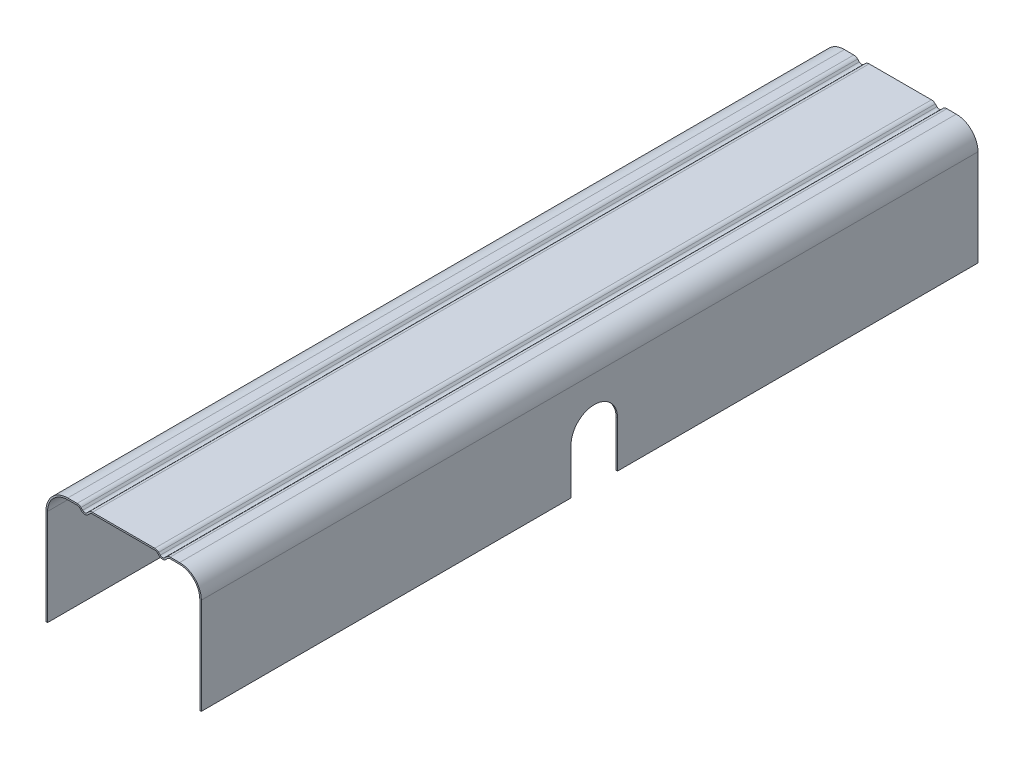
ISO-10303-21;
HEADER;
FILE_DESCRIPTION(('STEP AP214'),'2;1');
FILE_NAME('part.step','',(''),(''),'','','');
FILE_SCHEMA(('AUTOMOTIVE_DESIGN { 1 0 10303 214 1 1 1 1 }'));
ENDSEC;
DATA;
#1=APPLICATION_CONTEXT('core data for automotive mechanical design processes');
#2=APPLICATION_PROTOCOL_DEFINITION('international standard','automotive_design',2000,#1);
#3=PRODUCT_CONTEXT('',#1,'mechanical');
#4=PRODUCT('Part','Part','',(#3));
#5=PRODUCT_RELATED_PRODUCT_CATEGORY('part','',(#4));
#6=PRODUCT_DEFINITION_FORMATION('','',#4);
#7=PRODUCT_DEFINITION_CONTEXT('part definition',#1,'design');
#8=PRODUCT_DEFINITION('design','',#6,#7);
#9=PRODUCT_DEFINITION_SHAPE('','',#8);
#10=(LENGTH_UNIT() NAMED_UNIT(*) SI_UNIT(.MILLI.,.METRE.));
#11=(NAMED_UNIT(*) PLANE_ANGLE_UNIT() SI_UNIT($,.RADIAN.));
#12=(NAMED_UNIT(*) SI_UNIT($,.STERADIAN.) SOLID_ANGLE_UNIT());
#13=UNCERTAINTY_MEASURE_WITH_UNIT(LENGTH_MEASURE(1.E-05),#10,'distance_accuracy_value','');
#14=(GEOMETRIC_REPRESENTATION_CONTEXT(3) GLOBAL_UNCERTAINTY_ASSIGNED_CONTEXT((#13)) GLOBAL_UNIT_ASSIGNED_CONTEXT((#10,
#11,#12)) REPRESENTATION_CONTEXT('',''));
#15=CARTESIAN_POINT('',(0.,0.,0.));
#16=DIRECTION('',(0.,0.,1.));
#17=DIRECTION('',(1.,0.,0.));
#18=AXIS2_PLACEMENT_3D('',#15,#16,#17);
#19=CARTESIAN_POINT('',(50.,-23.,500.));
#20=DIRECTION('',(0.,-1.,0.));
#21=DIRECTION('',(0.,0.,-1.));
#22=AXIS2_PLACEMENT_3D('',#19,#20,#21);
#23=PLANE('',#22);
#24=DIRECTION('',(-1.,0.,0.));
#25=VECTOR('',#24,1.);
#26=CARTESIAN_POINT('',(50.,-23.,262.000000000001));
#27=LINE('',#26,#25);
#28=CARTESIAN_POINT('',(50.,-23.,262.000000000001));
#29=VERTEX_POINT('',#28);
#30=CARTESIAN_POINT('',(49.,-23.,262.000000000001));
#31=VERTEX_POINT('',#30);
#32=EDGE_CURVE('E357',#29,#31,#27,.T.);
#33=ORIENTED_EDGE('',*,*,#32,.F.);
#34=DIRECTION('',(0.,0.,-1.));
#35=VECTOR('',#34,1.);
#36=CARTESIAN_POINT('',(50.,-23.,500.));
#37=LINE('',#36,#35);
#38=CARTESIAN_POINT('',(50.,-23.,500.));
#39=VERTEX_POINT('',#38);
#40=EDGE_CURVE('E636',#39,#29,#37,.T.);
#41=ORIENTED_EDGE('',*,*,#40,.F.);
#42=DIRECTION('',(-1.,0.,0.));
#43=VECTOR('',#42,1.);
#44=CARTESIAN_POINT('',(50.,-23.,500.));
#45=LINE('',#44,#43);
#46=CARTESIAN_POINT('',(49.,-23.,500.));
#47=VERTEX_POINT('',#46);
#48=EDGE_CURVE('E459',#39,#47,#45,.T.);
#49=ORIENTED_EDGE('',*,*,#48,.T.);
#50=DIRECTION('',(0.,0.,-1.));
#51=VECTOR('',#50,1.);
#52=CARTESIAN_POINT('',(49.,-23.,500.));
#53=LINE('',#52,#51);
#54=EDGE_CURVE('E640',#47,#31,#53,.T.);
#55=ORIENTED_EDGE('',*,*,#54,.T.);
#56=EDGE_LOOP('',(#33,#41,#49,#55));
#57=FACE_BOUND('',#56,.T.);
#58=ADVANCED_FACE('F31',(#57),#23,.T.);
#59=CARTESIAN_POINT('',(-49.,-23.,500.));
#60=DIRECTION('',(0.,-1.,0.));
#61=DIRECTION('',(0.,0.,-1.));
#62=AXIS2_PLACEMENT_3D('',#59,#60,#61);
#63=PLANE('',#62);
#64=DIRECTION('',(-1.,0.,0.));
#65=VECTOR('',#64,1.);
#66=CARTESIAN_POINT('',(-49.,-23.,262.000000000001));
#67=LINE('',#66,#65);
#68=CARTESIAN_POINT('',(-49.,-23.,262.000000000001));
#69=VERTEX_POINT('',#68);
#70=CARTESIAN_POINT('',(-50.,-23.,262.000000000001));
#71=VERTEX_POINT('',#70);
#72=EDGE_CURVE('E355',#69,#71,#67,.T.);
#73=ORIENTED_EDGE('',*,*,#72,.F.);
#74=DIRECTION('',(0.,0.,-1.));
#75=VECTOR('',#74,1.);
#76=CARTESIAN_POINT('',(-49.,-23.,500.));
#77=LINE('',#76,#75);
#78=CARTESIAN_POINT('',(-49.,-23.,500.));
#79=VERTEX_POINT('',#78);
#80=EDGE_CURVE('E597',#79,#69,#77,.T.);
#81=ORIENTED_EDGE('',*,*,#80,.F.);
#82=DIRECTION('',(-1.,0.,0.));
#83=VECTOR('',#82,1.);
#84=CARTESIAN_POINT('',(-49.,-23.,500.));
#85=LINE('',#84,#83);
#86=CARTESIAN_POINT('',(-50.,-23.,500.));
#87=VERTEX_POINT('',#86);
#88=EDGE_CURVE('E513',#79,#87,#85,.T.);
#89=ORIENTED_EDGE('',*,*,#88,.T.);
#90=DIRECTION('',(0.,0.,-1.));
#91=VECTOR('',#90,1.);
#92=CARTESIAN_POINT('',(-50.,-23.,500.));
#93=LINE('',#92,#91);
#94=EDGE_CURVE('E600',#87,#71,#93,.T.);
#95=ORIENTED_EDGE('',*,*,#94,.T.);
#96=EDGE_LOOP('',(#73,#81,#89,#95));
#97=FACE_BOUND('',#96,.T.);
#98=ADVANCED_FACE('F651',(#97),#63,.T.);
#99=CARTESIAN_POINT('',(49.,39.,500.));
#100=DIRECTION('',(1.,0.,0.));
#101=DIRECTION('',(0.,1.,0.));
#102=AXIS2_PLACEMENT_3D('',#99,#100,#101);
#103=PLANE('',#102);
#104=CARTESIAN_POINT('',(49.,6.53650459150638,247.000000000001));
#105=DIRECTION('',(1.,0.,0.));
#106=DIRECTION('',(0.,1.,0.));
#107=AXIS2_PLACEMENT_3D('',#104,#105,#106);
#108=CIRCLE('',#107,15.);
#109=CARTESIAN_POINT('',(49.,6.53650459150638,232.000000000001));
#110=VERTEX_POINT('',#109);
#111=CARTESIAN_POINT('',(49.,6.53650459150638,262.000000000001));
#112=VERTEX_POINT('',#111);
#113=EDGE_CURVE('E362',#110,#112,#108,.T.);
#114=ORIENTED_EDGE('',*,*,#113,.T.);
#115=DIRECTION('',(0.,-1.,0.));
#116=VECTOR('',#115,1.);
#117=CARTESIAN_POINT('',(49.,39.,262.000000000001));
#118=LINE('',#117,#116);
#119=EDGE_CURVE('E359',#112,#31,#118,.T.);
#120=ORIENTED_EDGE('',*,*,#119,.T.);
#121=ORIENTED_EDGE('',*,*,#54,.F.);
#122=DIRECTION('',(0.,-1.,0.));
#123=VECTOR('',#122,1.);
#124=CARTESIAN_POINT('',(49.,39.,500.));
#125=LINE('',#124,#123);
#126=CARTESIAN_POINT('',(49.,39.,500.));
#127=VERTEX_POINT('',#126);
#128=EDGE_CURVE('E457',#127,#47,#125,.T.);
#129=ORIENTED_EDGE('',*,*,#128,.F.);
#130=DIRECTION('',(0.,0.,-1.));
#131=VECTOR('',#130,1.);
#132=CARTESIAN_POINT('',(49.,39.,500.));
#133=LINE('',#132,#131);
#134=CARTESIAN_POINT('',(49.,39.,0.));
#135=VERTEX_POINT('',#134);
#136=EDGE_CURVE('E548',#127,#135,#133,.T.);
#137=ORIENTED_EDGE('',*,*,#136,.T.);
#138=DIRECTION('',(0.,-1.,0.));
#139=VECTOR('',#138,1.);
#140=CARTESIAN_POINT('',(49.,39.,0.));
#141=LINE('',#140,#139);
#142=CARTESIAN_POINT('',(49.,-23.,0.));
#143=VERTEX_POINT('',#142);
#144=EDGE_CURVE('E365',#135,#143,#141,.T.);
#145=ORIENTED_EDGE('',*,*,#144,.T.);
#146=CARTESIAN_POINT('',(49.,-23.,232.000000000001));
#147=VERTEX_POINT('',#146);
#148=EDGE_CURVE('E639',#147,#143,#53,.T.);
#149=ORIENTED_EDGE('',*,*,#148,.F.);
#150=DIRECTION('',(0.,1.,0.));
#151=VECTOR('',#150,1.);
#152=CARTESIAN_POINT('',(49.,39.,232.000000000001));
#153=LINE('',#152,#151);
#154=EDGE_CURVE('E352',#147,#110,#153,.T.);
#155=ORIENTED_EDGE('',*,*,#154,.T.);
#156=EDGE_LOOP('',(#114,#120,#121,#129,#137,#145,#149,#155));
#157=FACE_BOUND('',#156,.T.);
#158=ADVANCED_FACE('F33',(#157),#103,.F.);
#159=DIRECTION('',(1.,0.,0.));
#160=VECTOR('',#159,1.);
#161=CARTESIAN_POINT('',(50.,-23.,232.000000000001));
#162=LINE('',#161,#160);
#163=CARTESIAN_POINT('',(50.,-23.,232.000000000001));
#164=VERTEX_POINT('',#163);
#165=EDGE_CURVE('E46',#147,#164,#162,.T.);
#166=ORIENTED_EDGE('',*,*,#165,.F.);
#167=ORIENTED_EDGE('',*,*,#148,.T.);
#168=DIRECTION('',(-1.,0.,0.));
#169=VECTOR('',#168,1.);
#170=CARTESIAN_POINT('',(50.,-23.,0.));
#171=LINE('',#170,#169);
#172=CARTESIAN_POINT('',(50.,-23.,0.));
#173=VERTEX_POINT('',#172);
#174=EDGE_CURVE('E368',#173,#143,#171,.T.);
#175=ORIENTED_EDGE('',*,*,#174,.F.);
#176=EDGE_CURVE('E635',#164,#173,#37,.T.);
#177=ORIENTED_EDGE('',*,*,#176,.F.);
#178=EDGE_LOOP('',(#166,#167,#175,#177));
#179=FACE_BOUND('',#178,.T.);
#180=ADVANCED_FACE('F812',(#179),#23,.T.);
#181=CARTESIAN_POINT('',(50.,39.,500.));
#182=DIRECTION('',(1.,0.,0.));
#183=DIRECTION('',(0.,1.,0.));
#184=AXIS2_PLACEMENT_3D('',#181,#182,#183);
#185=PLANE('',#184);
#186=DIRECTION('',(0.,1.,0.));
#187=VECTOR('',#186,1.);
#188=CARTESIAN_POINT('',(50.,6.53650459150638,262.000000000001));
#189=LINE('',#188,#187);
#190=CARTESIAN_POINT('',(50.,6.53650459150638,262.000000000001));
#191=VERTEX_POINT('',#190);
#192=EDGE_CURVE('E320',#29,#191,#189,.T.);
#193=ORIENTED_EDGE('',*,*,#192,.T.);
#194=CARTESIAN_POINT('',(50.,6.53650459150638,247.000000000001));
#195=DIRECTION('',(-1.,0.,0.));
#196=DIRECTION('',(0.,-1.,0.));
#197=AXIS2_PLACEMENT_3D('',#194,#195,#196);
#198=CIRCLE('',#197,15.);
#199=CARTESIAN_POINT('',(50.,6.53650459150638,232.000000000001));
#200=VERTEX_POINT('',#199);
#201=EDGE_CURVE('E337',#191,#200,#198,.T.);
#202=ORIENTED_EDGE('',*,*,#201,.T.);
#203=DIRECTION('',(0.,-1.,0.));
#204=VECTOR('',#203,1.);
#205=CARTESIAN_POINT('',(50.,6.53650459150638,232.000000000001));
#206=LINE('',#205,#204);
#207=EDGE_CURVE('E342',#200,#164,#206,.T.);
#208=ORIENTED_EDGE('',*,*,#207,.T.);
#209=ORIENTED_EDGE('',*,*,#176,.T.);
#210=DIRECTION('',(0.,-1.,0.));
#211=VECTOR('',#210,1.);
#212=CARTESIAN_POINT('',(50.,39.,0.));
#213=LINE('',#212,#211);
#214=CARTESIAN_POINT('',(50.,39.,0.));
#215=VERTEX_POINT('',#214);
#216=EDGE_CURVE('E371',#215,#173,#213,.T.);
#217=ORIENTED_EDGE('',*,*,#216,.F.);
#218=DIRECTION('',(0.,0.,-1.));
#219=VECTOR('',#218,1.);
#220=CARTESIAN_POINT('',(50.,39.,500.));
#221=LINE('',#220,#219);
#222=CARTESIAN_POINT('',(50.,39.,500.));
#223=VERTEX_POINT('',#222);
#224=EDGE_CURVE('E633',#223,#215,#221,.T.);
#225=ORIENTED_EDGE('',*,*,#224,.F.);
#226=DIRECTION('',(0.,-1.,0.));
#227=VECTOR('',#226,1.);
#228=CARTESIAN_POINT('',(50.,39.,500.));
#229=LINE('',#228,#227);
#230=EDGE_CURVE('E462',#223,#39,#229,.T.);
#231=ORIENTED_EDGE('',*,*,#230,.T.);
#232=ORIENTED_EDGE('',*,*,#40,.T.);
#233=EDGE_LOOP('',(#193,#202,#208,#209,#217,#225,#231,#232));
#234=FACE_BOUND('',#233,.T.);
#235=ADVANCED_FACE('F753',(#234),#185,.T.);
#236=CARTESIAN_POINT('',(36.,39.,500.));
#237=DIRECTION('',(0.,0.,-1.));
#238=DIRECTION('',(-1.,0.,0.));
#239=AXIS2_PLACEMENT_3D('',#236,#237,#238);
#240=CYLINDRICAL_SURFACE('',#239,14.);
#241=CARTESIAN_POINT('',(36.,39.,0.));
#242=DIRECTION('',(0.,0.,-1.));
#243=DIRECTION('',(1.,0.,0.));
#244=AXIS2_PLACEMENT_3D('',#241,#242,#243);
#245=CIRCLE('',#244,14.);
#246=CARTESIAN_POINT('',(36.,53.,0.));
#247=VERTEX_POINT('',#246);
#248=EDGE_CURVE('E374',#247,#215,#245,.T.);
#249=ORIENTED_EDGE('',*,*,#248,.F.);
#250=DIRECTION('',(0.,0.,-1.));
#251=VECTOR('',#250,1.);
#252=CARTESIAN_POINT('',(36.,53.,500.));
#253=LINE('',#252,#251);
#254=CARTESIAN_POINT('',(36.,53.,500.));
#255=VERTEX_POINT('',#254);
#256=EDGE_CURVE('E631',#255,#247,#253,.T.);
#257=ORIENTED_EDGE('',*,*,#256,.F.);
#258=CARTESIAN_POINT('',(36.,39.,500.));
#259=DIRECTION('',(0.,0.,-1.));
#260=DIRECTION('',(1.,0.,0.));
#261=AXIS2_PLACEMENT_3D('',#258,#259,#260);
#262=CIRCLE('',#261,14.);
#263=EDGE_CURVE('E465',#255,#223,#262,.T.);
#264=ORIENTED_EDGE('',*,*,#263,.T.);
#265=ORIENTED_EDGE('',*,*,#224,.T.);
#266=EDGE_LOOP('',(#249,#257,#264,#265));
#267=FACE_BOUND('',#266,.T.);
#268=ADVANCED_FACE('F759',(#267),#240,.T.);
#269=CARTESIAN_POINT('',(29.9497474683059,53.,500.));
#270=DIRECTION('',(0.,1.,0.));
#271=DIRECTION('',(0.,0.,1.));
#272=AXIS2_PLACEMENT_3D('',#269,#270,#271);
#273=PLANE('',#272);
#274=DIRECTION('',(1.,0.,0.));
#275=VECTOR('',#274,1.);
#276=CARTESIAN_POINT('',(29.9497474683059,53.,0.));
#277=LINE('',#276,#275);
#278=CARTESIAN_POINT('',(29.9497474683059,53.,0.));
#279=VERTEX_POINT('',#278);
#280=EDGE_CURVE('E377',#279,#247,#277,.T.);
#281=ORIENTED_EDGE('',*,*,#280,.F.);
#282=DIRECTION('',(0.,0.,-1.));
#283=VECTOR('',#282,1.);
#284=CARTESIAN_POINT('',(29.9497474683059,53.,500.));
#285=LINE('',#284,#283);
#286=CARTESIAN_POINT('',(29.9497474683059,53.,500.));
#287=VERTEX_POINT('',#286);
#288=EDGE_CURVE('E629',#287,#279,#285,.T.);
#289=ORIENTED_EDGE('',*,*,#288,.F.);
#290=DIRECTION('',(1.,0.,0.));
#291=VECTOR('',#290,1.);
#292=CARTESIAN_POINT('',(29.9497474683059,53.,500.));
#293=LINE('',#292,#291);
#294=EDGE_CURVE('E468',#287,#255,#293,.T.);
#295=ORIENTED_EDGE('',*,*,#294,.T.);
#296=ORIENTED_EDGE('',*,*,#256,.T.);
#297=EDGE_LOOP('',(#281,#289,#295,#296));
#298=FACE_BOUND('',#297,.T.);
#299=ADVANCED_FACE('F762',(#298),#273,.T.);
#300=CARTESIAN_POINT('',(29.9497474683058,49.5,500.));
#301=DIRECTION('',(0.,0.,-1.));
#302=DIRECTION('',(-1.,0.,0.));
#303=AXIS2_PLACEMENT_3D('',#300,#301,#302);
#304=CYLINDRICAL_SURFACE('',#303,3.5);
#305=CARTESIAN_POINT('',(29.9497474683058,49.5,0.));
#306=DIRECTION('',(0.,0.,-1.));
#307=DIRECTION('',(1.,0.,0.));
#308=AXIS2_PLACEMENT_3D('',#305,#306,#307);
#309=CIRCLE('',#308,3.5);
#310=CARTESIAN_POINT('',(27.4748737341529,51.9748737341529,0.));
#311=VERTEX_POINT('',#310);
#312=EDGE_CURVE('E380',#311,#279,#309,.T.);
#313=ORIENTED_EDGE('',*,*,#312,.F.);
#314=DIRECTION('',(0.,0.,-1.));
#315=VECTOR('',#314,1.);
#316=CARTESIAN_POINT('',(27.4748737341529,51.9748737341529,500.));
#317=LINE('',#316,#315);
#318=CARTESIAN_POINT('',(27.4748737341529,51.9748737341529,500.));
#319=VERTEX_POINT('',#318);
#320=EDGE_CURVE('E627',#319,#311,#317,.T.);
#321=ORIENTED_EDGE('',*,*,#320,.F.);
#322=CARTESIAN_POINT('',(29.9497474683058,49.5,500.));
#323=DIRECTION('',(0.,0.,-1.));
#324=DIRECTION('',(1.,0.,0.));
#325=AXIS2_PLACEMENT_3D('',#322,#323,#324);
#326=CIRCLE('',#325,3.5);
#327=EDGE_CURVE('E471',#319,#287,#326,.T.);
#328=ORIENTED_EDGE('',*,*,#327,.T.);
#329=ORIENTED_EDGE('',*,*,#288,.T.);
#330=EDGE_LOOP('',(#313,#321,#328,#329));
#331=FACE_BOUND('',#330,.T.);
#332=ADVANCED_FACE('F767',(#331),#304,.T.);
#333=CARTESIAN_POINT('',(26.4142135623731,50.9142135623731,500.));
#334=DIRECTION('',(-0.707106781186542,0.707106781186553,0.));
#335=DIRECTION('',(-0.707106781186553,-0.707106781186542,0.));
#336=AXIS2_PLACEMENT_3D('',#333,#334,#335);
#337=PLANE('',#336);
#338=DIRECTION('',(0.707106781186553,0.707106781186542,0.));
#339=VECTOR('',#338,1.);
#340=CARTESIAN_POINT('',(26.4142135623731,50.9142135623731,0.));
#341=LINE('',#340,#339);
#342=CARTESIAN_POINT('',(26.4142135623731,50.9142135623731,0.));
#343=VERTEX_POINT('',#342);
#344=EDGE_CURVE('E383',#343,#311,#341,.T.);
#345=ORIENTED_EDGE('',*,*,#344,.F.);
#346=DIRECTION('',(0.,0.,-1.));
#347=VECTOR('',#346,1.);
#348=CARTESIAN_POINT('',(26.4142135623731,50.9142135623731,500.));
#349=LINE('',#348,#347);
#350=CARTESIAN_POINT('',(26.4142135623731,50.9142135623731,500.));
#351=VERTEX_POINT('',#350);
#352=EDGE_CURVE('E625',#351,#343,#349,.T.);
#353=ORIENTED_EDGE('',*,*,#352,.F.);
#354=DIRECTION('',(0.707106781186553,0.707106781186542,0.));
#355=VECTOR('',#354,1.);
#356=CARTESIAN_POINT('',(26.4142135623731,50.9142135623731,500.));
#357=LINE('',#356,#355);
#358=EDGE_CURVE('E474',#351,#319,#357,.T.);
#359=ORIENTED_EDGE('',*,*,#358,.T.);
#360=ORIENTED_EDGE('',*,*,#320,.T.);
#361=EDGE_LOOP('',(#345,#353,#359,#360));
#362=FACE_BOUND('',#361,.T.);
#363=ADVANCED_FACE('F770',(#362),#337,.T.);
#364=CARTESIAN_POINT('',(25.,52.3284271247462,500.));
#365=DIRECTION('',(0.,0.,-1.));
#366=DIRECTION('',(-1.,0.,0.));
#367=AXIS2_PLACEMENT_3D('',#364,#365,#366);
#368=CYLINDRICAL_SURFACE('',#367,1.99999999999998);
#369=CARTESIAN_POINT('',(25.,52.3284271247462,0.));
#370=DIRECTION('',(0.,0.,1.));
#371=DIRECTION('',(1.,0.,0.));
#372=AXIS2_PLACEMENT_3D('',#369,#370,#371);
#373=CIRCLE('',#372,1.99999999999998);
#374=CARTESIAN_POINT('',(23.5857864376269,50.9142135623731,0.));
#375=VERTEX_POINT('',#374);
#376=EDGE_CURVE('E386',#375,#343,#373,.T.);
#377=ORIENTED_EDGE('',*,*,#376,.F.);
#378=DIRECTION('',(0.,0.,-1.));
#379=VECTOR('',#378,1.);
#380=CARTESIAN_POINT('',(23.5857864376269,50.9142135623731,500.));
#381=LINE('',#380,#379);
#382=CARTESIAN_POINT('',(23.5857864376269,50.9142135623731,500.));
#383=VERTEX_POINT('',#382);
#384=EDGE_CURVE('E623',#383,#375,#381,.T.);
#385=ORIENTED_EDGE('',*,*,#384,.F.);
#386=CARTESIAN_POINT('',(25.,52.3284271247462,500.));
#387=DIRECTION('',(0.,0.,1.));
#388=DIRECTION('',(1.,0.,0.));
#389=AXIS2_PLACEMENT_3D('',#386,#387,#388);
#390=CIRCLE('',#389,1.99999999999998);
#391=EDGE_CURVE('E477',#383,#351,#390,.T.);
#392=ORIENTED_EDGE('',*,*,#391,.T.);
#393=ORIENTED_EDGE('',*,*,#352,.T.);
#394=EDGE_LOOP('',(#377,#385,#392,#393));
#395=FACE_BOUND('',#394,.T.);
#396=ADVANCED_FACE('F775',(#395),#368,.F.);
#397=CARTESIAN_POINT('',(22.5251262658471,51.9748737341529,500.));
#398=DIRECTION('',(0.70710678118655,0.707106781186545,0.));
#399=DIRECTION('',(-0.707106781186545,0.70710678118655,0.));
#400=AXIS2_PLACEMENT_3D('',#397,#398,#399);
#401=PLANE('',#400);
#402=DIRECTION('',(0.707106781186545,-0.70710678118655,0.));
#403=VECTOR('',#402,1.);
#404=CARTESIAN_POINT('',(22.5251262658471,51.9748737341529,0.));
#405=LINE('',#404,#403);
#406=CARTESIAN_POINT('',(22.5251262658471,51.9748737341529,0.));
#407=VERTEX_POINT('',#406);
#408=EDGE_CURVE('E389',#407,#375,#405,.T.);
#409=ORIENTED_EDGE('',*,*,#408,.F.);
#410=DIRECTION('',(0.,0.,-1.));
#411=VECTOR('',#410,1.);
#412=CARTESIAN_POINT('',(22.5251262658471,51.9748737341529,500.));
#413=LINE('',#412,#411);
#414=CARTESIAN_POINT('',(22.5251262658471,51.9748737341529,500.));
#415=VERTEX_POINT('',#414);
#416=EDGE_CURVE('E621',#415,#407,#413,.T.);
#417=ORIENTED_EDGE('',*,*,#416,.F.);
#418=DIRECTION('',(0.707106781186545,-0.70710678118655,0.));
#419=VECTOR('',#418,1.);
#420=CARTESIAN_POINT('',(22.5251262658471,51.9748737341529,500.));
#421=LINE('',#420,#419);
#422=EDGE_CURVE('E480',#415,#383,#421,.T.);
#423=ORIENTED_EDGE('',*,*,#422,.T.);
#424=ORIENTED_EDGE('',*,*,#384,.T.);
#425=EDGE_LOOP('',(#409,#417,#423,#424));
#426=FACE_BOUND('',#425,.T.);
#427=ADVANCED_FACE('F778',(#426),#401,.T.);
#428=CARTESIAN_POINT('',(20.0502525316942,49.5,500.));
#429=DIRECTION('',(0.,0.,-1.));
#430=DIRECTION('',(-1.,0.,0.));
#431=AXIS2_PLACEMENT_3D('',#428,#429,#430);
#432=CYLINDRICAL_SURFACE('',#431,3.5);
#433=CARTESIAN_POINT('',(20.0502525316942,49.5,0.));
#434=DIRECTION('',(0.,0.,-1.));
#435=DIRECTION('',(1.,0.,0.));
#436=AXIS2_PLACEMENT_3D('',#433,#434,#435);
#437=CIRCLE('',#436,3.5);
#438=CARTESIAN_POINT('',(20.0502525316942,53.,0.));
#439=VERTEX_POINT('',#438);
#440=EDGE_CURVE('E392',#439,#407,#437,.T.);
#441=ORIENTED_EDGE('',*,*,#440,.F.);
#442=DIRECTION('',(0.,0.,-1.));
#443=VECTOR('',#442,1.);
#444=CARTESIAN_POINT('',(20.0502525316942,53.,500.));
#445=LINE('',#444,#443);
#446=CARTESIAN_POINT('',(20.0502525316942,53.,500.));
#447=VERTEX_POINT('',#446);
#448=EDGE_CURVE('E619',#447,#439,#445,.T.);
#449=ORIENTED_EDGE('',*,*,#448,.F.);
#450=CARTESIAN_POINT('',(20.0502525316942,49.5,500.));
#451=DIRECTION('',(0.,0.,-1.));
#452=DIRECTION('',(1.,0.,0.));
#453=AXIS2_PLACEMENT_3D('',#450,#451,#452);
#454=CIRCLE('',#453,3.5);
#455=EDGE_CURVE('E483',#447,#415,#454,.T.);
#456=ORIENTED_EDGE('',*,*,#455,.T.);
#457=ORIENTED_EDGE('',*,*,#416,.T.);
#458=EDGE_LOOP('',(#441,#449,#456,#457));
#459=FACE_BOUND('',#458,.T.);
#460=ADVANCED_FACE('F783',(#459),#432,.T.);
#461=CARTESIAN_POINT('',(-20.0502525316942,53.,500.));
#462=DIRECTION('',(0.,1.,0.));
#463=DIRECTION('',(-1.,0.,0.));
#464=AXIS2_PLACEMENT_3D('',#461,#462,#463);
#465=PLANE('',#464);
#466=DIRECTION('',(1.,0.,0.));
#467=VECTOR('',#466,1.);
#468=CARTESIAN_POINT('',(-20.0502525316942,53.,0.));
#469=LINE('',#468,#467);
#470=CARTESIAN_POINT('',(-20.0502525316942,53.,0.));
#471=VERTEX_POINT('',#470);
#472=EDGE_CURVE('E395',#471,#439,#469,.T.);
#473=ORIENTED_EDGE('',*,*,#472,.F.);
#474=DIRECTION('',(0.,0.,-1.));
#475=VECTOR('',#474,1.);
#476=CARTESIAN_POINT('',(-20.0502525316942,53.,500.));
#477=LINE('',#476,#475);
#478=CARTESIAN_POINT('',(-20.0502525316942,53.,500.));
#479=VERTEX_POINT('',#478);
#480=EDGE_CURVE('E617',#479,#471,#477,.T.);
#481=ORIENTED_EDGE('',*,*,#480,.F.);
#482=DIRECTION('',(1.,0.,0.));
#483=VECTOR('',#482,1.);
#484=CARTESIAN_POINT('',(-20.0502525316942,53.,500.));
#485=LINE('',#484,#483);
#486=EDGE_CURVE('E486',#479,#447,#485,.T.);
#487=ORIENTED_EDGE('',*,*,#486,.T.);
#488=ORIENTED_EDGE('',*,*,#448,.T.);
#489=EDGE_LOOP('',(#473,#481,#487,#488));
#490=FACE_BOUND('',#489,.T.);
#491=ADVANCED_FACE('F786',(#490),#465,.T.);
#492=CARTESIAN_POINT('',(-20.0502525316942,49.5,500.));
#493=DIRECTION('',(0.,0.,-1.));
#494=DIRECTION('',(-1.,0.,0.));
#495=AXIS2_PLACEMENT_3D('',#492,#493,#494);
#496=CYLINDRICAL_SURFACE('',#495,3.5);
#497=CARTESIAN_POINT('',(-20.0502525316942,49.5,0.));
#498=DIRECTION('',(0.,0.,-1.));
#499=DIRECTION('',(1.,0.,0.));
#500=AXIS2_PLACEMENT_3D('',#497,#498,#499);
#501=CIRCLE('',#500,3.5);
#502=CARTESIAN_POINT('',(-22.5251262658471,51.9748737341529,0.));
#503=VERTEX_POINT('',#502);
#504=EDGE_CURVE('E398',#503,#471,#501,.T.);
#505=ORIENTED_EDGE('',*,*,#504,.F.);
#506=DIRECTION('',(0.,0.,-1.));
#507=VECTOR('',#506,1.);
#508=CARTESIAN_POINT('',(-22.5251262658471,51.9748737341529,500.));
#509=LINE('',#508,#507);
#510=CARTESIAN_POINT('',(-22.5251262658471,51.9748737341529,500.));
#511=VERTEX_POINT('',#510);
#512=EDGE_CURVE('E615',#511,#503,#509,.T.);
#513=ORIENTED_EDGE('',*,*,#512,.F.);
#514=CARTESIAN_POINT('',(-20.0502525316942,49.5,500.));
#515=DIRECTION('',(0.,0.,-1.));
#516=DIRECTION('',(1.,0.,0.));
#517=AXIS2_PLACEMENT_3D('',#514,#515,#516);
#518=CIRCLE('',#517,3.5);
#519=EDGE_CURVE('E489',#511,#479,#518,.T.);
#520=ORIENTED_EDGE('',*,*,#519,.T.);
#521=ORIENTED_EDGE('',*,*,#480,.T.);
#522=EDGE_LOOP('',(#505,#513,#520,#521));
#523=FACE_BOUND('',#522,.T.);
#524=ADVANCED_FACE('F791',(#523),#496,.T.);
#525=CARTESIAN_POINT('',(-23.5857864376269,50.9142135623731,500.));
#526=DIRECTION('',(-0.707106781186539,0.707106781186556,0.));
#527=DIRECTION('',(-0.707106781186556,-0.707106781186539,0.));
#528=AXIS2_PLACEMENT_3D('',#525,#526,#527);
#529=PLANE('',#528);
#530=DIRECTION('',(0.707106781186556,0.707106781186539,0.));
#531=VECTOR('',#530,1.);
#532=CARTESIAN_POINT('',(-23.5857864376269,50.9142135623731,0.));
#533=LINE('',#532,#531);
#534=CARTESIAN_POINT('',(-23.5857864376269,50.9142135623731,0.));
#535=VERTEX_POINT('',#534);
#536=EDGE_CURVE('E401',#535,#503,#533,.T.);
#537=ORIENTED_EDGE('',*,*,#536,.F.);
#538=DIRECTION('',(0.,0.,-1.));
#539=VECTOR('',#538,1.);
#540=CARTESIAN_POINT('',(-23.5857864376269,50.9142135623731,500.));
#541=LINE('',#540,#539);
#542=CARTESIAN_POINT('',(-23.5857864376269,50.9142135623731,500.));
#543=VERTEX_POINT('',#542);
#544=EDGE_CURVE('E613',#543,#535,#541,.T.);
#545=ORIENTED_EDGE('',*,*,#544,.F.);
#546=DIRECTION('',(0.707106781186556,0.707106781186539,0.));
#547=VECTOR('',#546,1.);
#548=CARTESIAN_POINT('',(-23.5857864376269,50.9142135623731,500.));
#549=LINE('',#548,#547);
#550=EDGE_CURVE('E492',#543,#511,#549,.T.);
#551=ORIENTED_EDGE('',*,*,#550,.T.);
#552=ORIENTED_EDGE('',*,*,#512,.T.);
#553=EDGE_LOOP('',(#537,#545,#551,#552));
#554=FACE_BOUND('',#553,.T.);
#555=ADVANCED_FACE('F794',(#554),#529,.T.);
#556=CARTESIAN_POINT('',(-25.,52.3284271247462,500.));
#557=DIRECTION('',(0.,0.,-1.));
#558=DIRECTION('',(-1.,0.,0.));
#559=AXIS2_PLACEMENT_3D('',#556,#557,#558);
#560=CYLINDRICAL_SURFACE('',#559,1.99999999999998);
#561=CARTESIAN_POINT('',(-25.,52.3284271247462,0.));
#562=DIRECTION('',(0.,0.,1.));
#563=DIRECTION('',(1.,0.,0.));
#564=AXIS2_PLACEMENT_3D('',#561,#562,#563);
#565=CIRCLE('',#564,1.99999999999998);
#566=CARTESIAN_POINT('',(-26.4142135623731,50.9142135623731,0.));
#567=VERTEX_POINT('',#566);
#568=EDGE_CURVE('E404',#567,#535,#565,.T.);
#569=ORIENTED_EDGE('',*,*,#568,.F.);
#570=DIRECTION('',(0.,0.,-1.));
#571=VECTOR('',#570,1.);
#572=CARTESIAN_POINT('',(-26.4142135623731,50.9142135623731,500.));
#573=LINE('',#572,#571);
#574=CARTESIAN_POINT('',(-26.4142135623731,50.9142135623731,500.));
#575=VERTEX_POINT('',#574);
#576=EDGE_CURVE('E611',#575,#567,#573,.T.);
#577=ORIENTED_EDGE('',*,*,#576,.F.);
#578=CARTESIAN_POINT('',(-25.,52.3284271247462,500.));
#579=DIRECTION('',(0.,0.,1.));
#580=DIRECTION('',(1.,0.,0.));
#581=AXIS2_PLACEMENT_3D('',#578,#579,#580);
#582=CIRCLE('',#581,1.99999999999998);
#583=EDGE_CURVE('E495',#575,#543,#582,.T.);
#584=ORIENTED_EDGE('',*,*,#583,.T.);
#585=ORIENTED_EDGE('',*,*,#544,.T.);
#586=EDGE_LOOP('',(#569,#577,#584,#585));
#587=FACE_BOUND('',#586,.T.);
#588=ADVANCED_FACE('F799',(#587),#560,.F.);
#589=CARTESIAN_POINT('',(-27.4748737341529,51.9748737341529,500.));
#590=DIRECTION('',(0.707106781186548,0.707106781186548,0.));
#591=DIRECTION('',(-0.707106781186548,0.707106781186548,0.));
#592=AXIS2_PLACEMENT_3D('',#589,#590,#591);
#593=PLANE('',#592);
#594=DIRECTION('',(0.707106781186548,-0.707106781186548,0.));
#595=VECTOR('',#594,1.);
#596=CARTESIAN_POINT('',(-27.4748737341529,51.9748737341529,0.));
#597=LINE('',#596,#595);
#598=CARTESIAN_POINT('',(-27.4748737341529,51.9748737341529,0.));
#599=VERTEX_POINT('',#598);
#600=EDGE_CURVE('E407',#599,#567,#597,.T.);
#601=ORIENTED_EDGE('',*,*,#600,.F.);
#602=DIRECTION('',(0.,0.,-1.));
#603=VECTOR('',#602,1.);
#604=CARTESIAN_POINT('',(-27.4748737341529,51.9748737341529,500.));
#605=LINE('',#604,#603);
#606=CARTESIAN_POINT('',(-27.4748737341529,51.9748737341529,500.));
#607=VERTEX_POINT('',#606);
#608=EDGE_CURVE('E609',#607,#599,#605,.T.);
#609=ORIENTED_EDGE('',*,*,#608,.F.);
#610=DIRECTION('',(0.707106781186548,-0.707106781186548,0.));
#611=VECTOR('',#610,1.);
#612=CARTESIAN_POINT('',(-27.4748737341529,51.9748737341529,500.));
#613=LINE('',#612,#611);
#614=EDGE_CURVE('E498',#607,#575,#613,.T.);
#615=ORIENTED_EDGE('',*,*,#614,.T.);
#616=ORIENTED_EDGE('',*,*,#576,.T.);
#617=EDGE_LOOP('',(#601,#609,#615,#616));
#618=FACE_BOUND('',#617,.T.);
#619=ADVANCED_FACE('F802',(#618),#593,.T.);
#620=CARTESIAN_POINT('',(-29.9497474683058,49.5,500.));
#621=DIRECTION('',(0.,0.,-1.));
#622=DIRECTION('',(-1.,0.,0.));
#623=AXIS2_PLACEMENT_3D('',#620,#621,#622);
#624=CYLINDRICAL_SURFACE('',#623,3.5);
#625=CARTESIAN_POINT('',(-29.9497474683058,49.5,0.));
#626=DIRECTION('',(0.,0.,-1.));
#627=DIRECTION('',(1.,0.,0.));
#628=AXIS2_PLACEMENT_3D('',#625,#626,#627);
#629=CIRCLE('',#628,3.5);
#630=CARTESIAN_POINT('',(-29.9497474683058,53.,0.));
#631=VERTEX_POINT('',#630);
#632=EDGE_CURVE('E410',#631,#599,#629,.T.);
#633=ORIENTED_EDGE('',*,*,#632,.F.);
#634=DIRECTION('',(0.,0.,-1.));
#635=VECTOR('',#634,1.);
#636=CARTESIAN_POINT('',(-29.9497474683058,53.,500.));
#637=LINE('',#636,#635);
#638=CARTESIAN_POINT('',(-29.9497474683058,53.,500.));
#639=VERTEX_POINT('',#638);
#640=EDGE_CURVE('E607',#639,#631,#637,.T.);
#641=ORIENTED_EDGE('',*,*,#640,.F.);
#642=CARTESIAN_POINT('',(-29.9497474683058,49.5,500.));
#643=DIRECTION('',(0.,0.,-1.));
#644=DIRECTION('',(1.,0.,0.));
#645=AXIS2_PLACEMENT_3D('',#642,#643,#644);
#646=CIRCLE('',#645,3.5);
#647=EDGE_CURVE('E501',#639,#607,#646,.T.);
#648=ORIENTED_EDGE('',*,*,#647,.T.);
#649=ORIENTED_EDGE('',*,*,#608,.T.);
#650=EDGE_LOOP('',(#633,#641,#648,#649));
#651=FACE_BOUND('',#650,.T.);
#652=ADVANCED_FACE('F806',(#651),#624,.T.);
#653=CARTESIAN_POINT('',(-36.,53.,500.));
#654=DIRECTION('',(0.,1.,0.));
#655=DIRECTION('',(0.,0.,1.));
#656=AXIS2_PLACEMENT_3D('',#653,#654,#655);
#657=PLANE('',#656);
#658=DIRECTION('',(1.,0.,0.));
#659=VECTOR('',#658,1.);
#660=CARTESIAN_POINT('',(-36.,53.,0.));
#661=LINE('',#660,#659);
#662=CARTESIAN_POINT('',(-36.,53.,0.));
#663=VERTEX_POINT('',#662);
#664=EDGE_CURVE('E413',#663,#631,#661,.T.);
#665=ORIENTED_EDGE('',*,*,#664,.F.);
#666=DIRECTION('',(0.,0.,-1.));
#667=VECTOR('',#666,1.);
#668=CARTESIAN_POINT('',(-36.,53.,500.));
#669=LINE('',#668,#667);
#670=CARTESIAN_POINT('',(-36.,53.,500.));
#671=VERTEX_POINT('',#670);
#672=EDGE_CURVE('E605',#671,#663,#669,.T.);
#673=ORIENTED_EDGE('',*,*,#672,.F.);
#674=DIRECTION('',(1.,0.,0.));
#675=VECTOR('',#674,1.);
#676=CARTESIAN_POINT('',(-36.,53.,500.));
#677=LINE('',#676,#675);
#678=EDGE_CURVE('E504',#671,#639,#677,.T.);
#679=ORIENTED_EDGE('',*,*,#678,.T.);
#680=ORIENTED_EDGE('',*,*,#640,.T.);
#681=EDGE_LOOP('',(#665,#673,#679,#680));
#682=FACE_BOUND('',#681,.T.);
#683=ADVANCED_FACE('F808',(#682),#657,.T.);
#684=CARTESIAN_POINT('',(-36.,39.,500.));
#685=DIRECTION('',(0.,0.,-1.));
#686=DIRECTION('',(-1.,0.,0.));
#687=AXIS2_PLACEMENT_3D('',#684,#685,#686);
#688=CYLINDRICAL_SURFACE('',#687,14.);
#689=CARTESIAN_POINT('',(-36.,39.,0.));
#690=DIRECTION('',(0.,0.,-1.));
#691=DIRECTION('',(1.,0.,0.));
#692=AXIS2_PLACEMENT_3D('',#689,#690,#691);
#693=CIRCLE('',#692,14.);
#694=CARTESIAN_POINT('',(-50.,39.,0.));
#695=VERTEX_POINT('',#694);
#696=EDGE_CURVE('E416',#695,#663,#693,.T.);
#697=ORIENTED_EDGE('',*,*,#696,.F.);
#698=DIRECTION('',(0.,0.,-1.));
#699=VECTOR('',#698,1.);
#700=CARTESIAN_POINT('',(-50.,39.,500.));
#701=LINE('',#700,#699);
#702=CARTESIAN_POINT('',(-50.,39.,500.));
#703=VERTEX_POINT('',#702);
#704=EDGE_CURVE('E603',#703,#695,#701,.T.);
#705=ORIENTED_EDGE('',*,*,#704,.F.);
#706=CARTESIAN_POINT('',(-36.,39.,500.));
#707=DIRECTION('',(0.,0.,-1.));
#708=DIRECTION('',(1.,0.,0.));
#709=AXIS2_PLACEMENT_3D('',#706,#707,#708);
#710=CIRCLE('',#709,14.);
#711=EDGE_CURVE('E507',#703,#671,#710,.T.);
#712=ORIENTED_EDGE('',*,*,#711,.T.);
#713=ORIENTED_EDGE('',*,*,#672,.T.);
#714=EDGE_LOOP('',(#697,#705,#712,#713));
#715=FACE_BOUND('',#714,.T.);
#716=ADVANCED_FACE('F661',(#715),#688,.T.);
#717=CARTESIAN_POINT('',(-50.,-23.,500.));
#718=DIRECTION('',(-1.,0.,0.));
#719=DIRECTION('',(0.,-1.,0.));
#720=AXIS2_PLACEMENT_3D('',#717,#718,#719);
#721=PLANE('',#720);
#722=DIRECTION('',(0.,1.,0.));
#723=VECTOR('',#722,1.);
#724=CARTESIAN_POINT('',(-50.,6.53650459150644,262.000000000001));
#725=LINE('',#724,#723);
#726=CARTESIAN_POINT('',(-50.,6.53650459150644,262.000000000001));
#727=VERTEX_POINT('',#726);
#728=EDGE_CURVE('E335',#71,#727,#725,.T.);
#729=ORIENTED_EDGE('',*,*,#728,.F.);
#730=ORIENTED_EDGE('',*,*,#94,.F.);
#731=DIRECTION('',(0.,1.,0.));
#732=VECTOR('',#731,1.);
#733=CARTESIAN_POINT('',(-50.,-23.,500.));
#734=LINE('',#733,#732);
#735=EDGE_CURVE('E510',#87,#703,#734,.T.);
#736=ORIENTED_EDGE('',*,*,#735,.T.);
#737=ORIENTED_EDGE('',*,*,#704,.T.);
#738=DIRECTION('',(0.,1.,0.));
#739=VECTOR('',#738,1.);
#740=CARTESIAN_POINT('',(-50.,-23.,0.));
#741=LINE('',#740,#739);
#742=CARTESIAN_POINT('',(-50.,-23.,0.));
#743=VERTEX_POINT('',#742);
#744=EDGE_CURVE('E419',#743,#695,#741,.T.);
#745=ORIENTED_EDGE('',*,*,#744,.F.);
#746=CARTESIAN_POINT('',(-50.,-23.,232.000000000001));
#747=VERTEX_POINT('',#746);
#748=EDGE_CURVE('E334',#747,#743,#93,.T.);
#749=ORIENTED_EDGE('',*,*,#748,.F.);
#750=DIRECTION('',(0.,-1.,0.));
#751=VECTOR('',#750,1.);
#752=CARTESIAN_POINT('',(-50.,6.53650459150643,232.000000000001));
#753=LINE('',#752,#751);
#754=CARTESIAN_POINT('',(-50.,6.53650459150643,232.000000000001));
#755=VERTEX_POINT('',#754);
#756=EDGE_CURVE('E315',#755,#747,#753,.T.);
#757=ORIENTED_EDGE('',*,*,#756,.F.);
#758=CARTESIAN_POINT('',(-50.,6.53650459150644,247.000000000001));
#759=DIRECTION('',(-1.,0.,0.));
#760=DIRECTION('',(0.,-1.,0.));
#761=AXIS2_PLACEMENT_3D('',#758,#759,#760);
#762=CIRCLE('',#761,15.);
#763=EDGE_CURVE('E323',#727,#755,#762,.T.);
#764=ORIENTED_EDGE('',*,*,#763,.F.);
#765=EDGE_LOOP('',(#729,#730,#736,#737,#745,#749,#757,#764));
#766=FACE_BOUND('',#765,.T.);
#767=ADVANCED_FACE('F332',(#766),#721,.T.);
#768=DIRECTION('',(1.,0.,0.));
#769=VECTOR('',#768,1.);
#770=CARTESIAN_POINT('',(-49.,-23.,232.000000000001));
#771=LINE('',#770,#769);
#772=CARTESIAN_POINT('',(-49.,-23.,232.000000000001));
#773=VERTEX_POINT('',#772);
#774=EDGE_CURVE('E54',#747,#773,#771,.T.);
#775=ORIENTED_EDGE('',*,*,#774,.F.);
#776=ORIENTED_EDGE('',*,*,#748,.T.);
#777=DIRECTION('',(-1.,0.,0.));
#778=VECTOR('',#777,1.);
#779=CARTESIAN_POINT('',(-49.,-23.,0.));
#780=LINE('',#779,#778);
#781=CARTESIAN_POINT('',(-49.,-23.,0.));
#782=VERTEX_POINT('',#781);
#783=EDGE_CURVE('E422',#782,#743,#780,.T.);
#784=ORIENTED_EDGE('',*,*,#783,.F.);
#785=EDGE_CURVE('E596',#773,#782,#77,.T.);
#786=ORIENTED_EDGE('',*,*,#785,.F.);
#787=EDGE_LOOP('',(#775,#776,#784,#786));
#788=FACE_BOUND('',#787,.T.);
#789=ADVANCED_FACE('F670',(#788),#63,.T.);
#790=CARTESIAN_POINT('',(-49.,-23.,500.));
#791=DIRECTION('',(-1.,0.,0.));
#792=DIRECTION('',(0.,-1.,0.));
#793=AXIS2_PLACEMENT_3D('',#790,#791,#792);
#794=PLANE('',#793);
#795=ORIENTED_EDGE('',*,*,#80,.T.);
#796=DIRECTION('',(0.,1.,0.));
#797=VECTOR('',#796,1.);
#798=CARTESIAN_POINT('',(-49.,-23.,262.000000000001));
#799=LINE('',#798,#797);
#800=CARTESIAN_POINT('',(-49.,6.53650459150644,262.000000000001));
#801=VERTEX_POINT('',#800);
#802=EDGE_CURVE('E11',#69,#801,#799,.T.);
#803=ORIENTED_EDGE('',*,*,#802,.T.);
#804=CARTESIAN_POINT('',(-49.,6.53650459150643,247.000000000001));
#805=DIRECTION('',(-1.,0.,0.));
#806=DIRECTION('',(0.,-1.,0.));
#807=AXIS2_PLACEMENT_3D('',#804,#805,#806);
#808=CIRCLE('',#807,15.);
#809=CARTESIAN_POINT('',(-49.,6.53650459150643,232.000000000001));
#810=VERTEX_POINT('',#809);
#811=EDGE_CURVE('E39',#801,#810,#808,.T.);
#812=ORIENTED_EDGE('',*,*,#811,.T.);
#813=DIRECTION('',(0.,-1.,0.));
#814=VECTOR('',#813,1.);
#815=CARTESIAN_POINT('',(-49.,-23.,232.000000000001));
#816=LINE('',#815,#814);
#817=EDGE_CURVE('E316',#810,#773,#816,.T.);
#818=ORIENTED_EDGE('',*,*,#817,.T.);
#819=ORIENTED_EDGE('',*,*,#785,.T.);
#820=DIRECTION('',(0.,1.,0.));
#821=VECTOR('',#820,1.);
#822=CARTESIAN_POINT('',(-49.,-23.,0.));
#823=LINE('',#822,#821);
#824=CARTESIAN_POINT('',(-49.,39.,0.));
#825=VERTEX_POINT('',#824);
#826=EDGE_CURVE('E425',#782,#825,#823,.T.);
#827=ORIENTED_EDGE('',*,*,#826,.T.);
#828=DIRECTION('',(0.,0.,-1.));
#829=VECTOR('',#828,1.);
#830=CARTESIAN_POINT('',(-49.,39.,500.));
#831=LINE('',#830,#829);
#832=CARTESIAN_POINT('',(-49.,39.,500.));
#833=VERTEX_POINT('',#832);
#834=EDGE_CURVE('E593',#833,#825,#831,.T.);
#835=ORIENTED_EDGE('',*,*,#834,.F.);
#836=DIRECTION('',(0.,1.,0.));
#837=VECTOR('',#836,1.);
#838=CARTESIAN_POINT('',(-49.,-23.,500.));
#839=LINE('',#838,#837);
#840=EDGE_CURVE('E516',#79,#833,#839,.T.);
#841=ORIENTED_EDGE('',*,*,#840,.F.);
#842=EDGE_LOOP('',(#795,#803,#812,#818,#819,#827,#835,#841));
#843=FACE_BOUND('',#842,.T.);
#844=ADVANCED_FACE('F644',(#843),#794,.F.);
#845=CARTESIAN_POINT('',(-36.,39.,500.));
#846=DIRECTION('',(0.,0.,-1.));
#847=DIRECTION('',(-1.,0.,0.));
#848=AXIS2_PLACEMENT_3D('',#845,#846,#847);
#849=CYLINDRICAL_SURFACE('',#848,13.);
#850=CARTESIAN_POINT('',(-36.,39.,0.));
#851=DIRECTION('',(0.,0.,1.));
#852=DIRECTION('',(1.,0.,0.));
#853=AXIS2_PLACEMENT_3D('',#850,#851,#852);
#854=CIRCLE('',#853,13.);
#855=CARTESIAN_POINT('',(-36.,52.,0.));
#856=VERTEX_POINT('',#855);
#857=EDGE_CURVE('E427',#825,#856,#854,.F.);
#858=ORIENTED_EDGE('',*,*,#857,.T.);
#859=DIRECTION('',(0.,0.,-1.));
#860=VECTOR('',#859,1.);
#861=CARTESIAN_POINT('',(-36.,52.,500.));
#862=LINE('',#861,#860);
#863=CARTESIAN_POINT('',(-36.,52.,500.));
#864=VERTEX_POINT('',#863);
#865=EDGE_CURVE('E590',#864,#856,#862,.T.);
#866=ORIENTED_EDGE('',*,*,#865,.F.);
#867=CARTESIAN_POINT('',(-36.,39.,500.));
#868=DIRECTION('',(0.,0.,1.));
#869=DIRECTION('',(1.,0.,0.));
#870=AXIS2_PLACEMENT_3D('',#867,#868,#869);
#871=CIRCLE('',#870,13.);
#872=EDGE_CURVE('E518',#833,#864,#871,.F.);
#873=ORIENTED_EDGE('',*,*,#872,.F.);
#874=ORIENTED_EDGE('',*,*,#834,.T.);
#875=EDGE_LOOP('',(#858,#866,#873,#874));
#876=FACE_BOUND('',#875,.T.);
#877=ADVANCED_FACE('F673',(#876),#849,.F.);
#878=CARTESIAN_POINT('',(-36.,52.,500.));
#879=DIRECTION('',(0.,1.,0.));
#880=DIRECTION('',(0.,0.,1.));
#881=AXIS2_PLACEMENT_3D('',#878,#879,#880);
#882=PLANE('',#881);
#883=DIRECTION('',(1.,0.,0.));
#884=VECTOR('',#883,1.);
#885=CARTESIAN_POINT('',(-36.,52.,0.));
#886=LINE('',#885,#884);
#887=CARTESIAN_POINT('',(-29.9497474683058,52.,0.));
#888=VERTEX_POINT('',#887);
#889=EDGE_CURVE('E429',#856,#888,#886,.T.);
#890=ORIENTED_EDGE('',*,*,#889,.T.);
#891=DIRECTION('',(0.,0.,-1.));
#892=VECTOR('',#891,1.);
#893=CARTESIAN_POINT('',(-29.9497474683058,52.,500.));
#894=LINE('',#893,#892);
#895=CARTESIAN_POINT('',(-29.9497474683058,52.,500.));
#896=VERTEX_POINT('',#895);
#897=EDGE_CURVE('E587',#896,#888,#894,.T.);
#898=ORIENTED_EDGE('',*,*,#897,.F.);
#899=DIRECTION('',(1.,0.,0.));
#900=VECTOR('',#899,1.);
#901=CARTESIAN_POINT('',(-36.,52.,500.));
#902=LINE('',#901,#900);
#903=EDGE_CURVE('E520',#864,#896,#902,.T.);
#904=ORIENTED_EDGE('',*,*,#903,.F.);
#905=ORIENTED_EDGE('',*,*,#865,.T.);
#906=EDGE_LOOP('',(#890,#898,#904,#905));
#907=FACE_BOUND('',#906,.T.);
#908=ADVANCED_FACE('F680',(#907),#882,.F.);
#909=CARTESIAN_POINT('',(-29.9497474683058,49.5,500.));
#910=DIRECTION('',(0.,0.,-1.));
#911=DIRECTION('',(-1.,0.,0.));
#912=AXIS2_PLACEMENT_3D('',#909,#910,#911);
#913=CYLINDRICAL_SURFACE('',#912,2.5);
#914=CARTESIAN_POINT('',(-29.9497474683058,49.5,0.));
#915=DIRECTION('',(0.,0.,1.));
#916=DIRECTION('',(1.,0.,0.));
#917=AXIS2_PLACEMENT_3D('',#914,#915,#916);
#918=CIRCLE('',#917,2.5);
#919=CARTESIAN_POINT('',(-28.1819805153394,51.2677669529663,0.));
#920=VERTEX_POINT('',#919);
#921=EDGE_CURVE('E431',#888,#920,#918,.F.);
#922=ORIENTED_EDGE('',*,*,#921,.T.);
#923=DIRECTION('',(0.,0.,-1.));
#924=VECTOR('',#923,1.);
#925=CARTESIAN_POINT('',(-28.1819805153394,51.2677669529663,500.));
#926=LINE('',#925,#924);
#927=CARTESIAN_POINT('',(-28.1819805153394,51.2677669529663,500.));
#928=VERTEX_POINT('',#927);
#929=EDGE_CURVE('E584',#928,#920,#926,.T.);
#930=ORIENTED_EDGE('',*,*,#929,.F.);
#931=CARTESIAN_POINT('',(-29.9497474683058,49.5,500.));
#932=DIRECTION('',(0.,0.,1.));
#933=DIRECTION('',(1.,0.,0.));
#934=AXIS2_PLACEMENT_3D('',#931,#932,#933);
#935=CIRCLE('',#934,2.5);
#936=EDGE_CURVE('E522',#896,#928,#935,.F.);
#937=ORIENTED_EDGE('',*,*,#936,.F.);
#938=ORIENTED_EDGE('',*,*,#897,.T.);
#939=EDGE_LOOP('',(#922,#930,#937,#938));
#940=FACE_BOUND('',#939,.T.);
#941=ADVANCED_FACE('F684',(#940),#913,.F.);
#942=CARTESIAN_POINT('',(-28.1819805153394,51.2677669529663,500.));
#943=DIRECTION('',(0.707106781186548,0.707106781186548,0.));
#944=DIRECTION('',(-0.707106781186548,0.707106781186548,0.));
#945=AXIS2_PLACEMENT_3D('',#942,#943,#944);
#946=PLANE('',#945);
#947=DIRECTION('',(0.707106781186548,-0.707106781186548,0.));
#948=VECTOR('',#947,1.);
#949=CARTESIAN_POINT('',(-28.1819805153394,51.2677669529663,0.));
#950=LINE('',#949,#948);
#951=CARTESIAN_POINT('',(-27.1213203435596,50.2071067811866,0.));
#952=VERTEX_POINT('',#951);
#953=EDGE_CURVE('E433',#920,#952,#950,.T.);
#954=ORIENTED_EDGE('',*,*,#953,.T.);
#955=DIRECTION('',(0.,0.,-1.));
#956=VECTOR('',#955,1.);
#957=CARTESIAN_POINT('',(-27.1213203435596,50.2071067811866,500.));
#958=LINE('',#957,#956);
#959=CARTESIAN_POINT('',(-27.1213203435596,50.2071067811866,500.));
#960=VERTEX_POINT('',#959);
#961=EDGE_CURVE('E581',#960,#952,#958,.T.);
#962=ORIENTED_EDGE('',*,*,#961,.F.);
#963=DIRECTION('',(0.707106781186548,-0.707106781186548,0.));
#964=VECTOR('',#963,1.);
#965=CARTESIAN_POINT('',(-28.1819805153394,51.2677669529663,500.));
#966=LINE('',#965,#964);
#967=EDGE_CURVE('E524',#928,#960,#966,.T.);
#968=ORIENTED_EDGE('',*,*,#967,.F.);
#969=ORIENTED_EDGE('',*,*,#929,.T.);
#970=EDGE_LOOP('',(#954,#962,#968,#969));
#971=FACE_BOUND('',#970,.T.);
#972=ADVANCED_FACE('F691',(#971),#946,.F.);
#973=CARTESIAN_POINT('',(-25.,52.3284271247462,500.));
#974=DIRECTION('',(0.,0.,-1.));
#975=DIRECTION('',(-1.,0.,0.));
#976=AXIS2_PLACEMENT_3D('',#973,#974,#975);
#977=CYLINDRICAL_SURFACE('',#976,2.99999999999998);
#978=CARTESIAN_POINT('',(-25.,52.3284271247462,0.));
#979=DIRECTION('',(0.,0.,1.));
#980=DIRECTION('',(1.,0.,0.));
#981=AXIS2_PLACEMENT_3D('',#978,#979,#980);
#982=CIRCLE('',#981,2.99999999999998);
#983=CARTESIAN_POINT('',(-22.8786796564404,50.2071067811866,0.));
#984=VERTEX_POINT('',#983);
#985=EDGE_CURVE('E435',#952,#984,#982,.T.);
#986=ORIENTED_EDGE('',*,*,#985,.T.);
#987=DIRECTION('',(0.,0.,-1.));
#988=VECTOR('',#987,1.);
#989=CARTESIAN_POINT('',(-22.8786796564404,50.2071067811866,500.));
#990=LINE('',#989,#988);
#991=CARTESIAN_POINT('',(-22.8786796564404,50.2071067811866,500.));
#992=VERTEX_POINT('',#991);
#993=EDGE_CURVE('E578',#992,#984,#990,.T.);
#994=ORIENTED_EDGE('',*,*,#993,.F.);
#995=CARTESIAN_POINT('',(-25.,52.3284271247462,500.));
#996=DIRECTION('',(0.,0.,1.));
#997=DIRECTION('',(1.,0.,0.));
#998=AXIS2_PLACEMENT_3D('',#995,#996,#997);
#999=CIRCLE('',#998,2.99999999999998);
#1000=EDGE_CURVE('E526',#960,#992,#999,.T.);
#1001=ORIENTED_EDGE('',*,*,#1000,.F.);
#1002=ORIENTED_EDGE('',*,*,#961,.T.);
#1003=EDGE_LOOP('',(#986,#994,#1001,#1002));
#1004=FACE_BOUND('',#1003,.T.);
#1005=ADVANCED_FACE('F694',(#1004),#977,.T.);
#1006=CARTESIAN_POINT('',(-22.8786796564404,50.2071067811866,500.));
#1007=DIRECTION('',(-0.707106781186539,0.707106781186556,0.));
#1008=DIRECTION('',(-0.707106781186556,-0.707106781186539,0.));
#1009=AXIS2_PLACEMENT_3D('',#1006,#1007,#1008);
#1010=PLANE('',#1009);
#1011=DIRECTION('',(0.707106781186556,0.707106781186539,0.));
#1012=VECTOR('',#1011,1.);
#1013=CARTESIAN_POINT('',(-22.8786796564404,50.2071067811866,0.));
#1014=LINE('',#1013,#1012);
#1015=CARTESIAN_POINT('',(-21.8180194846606,51.2677669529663,0.));
#1016=VERTEX_POINT('',#1015);
#1017=EDGE_CURVE('E437',#984,#1016,#1014,.T.);
#1018=ORIENTED_EDGE('',*,*,#1017,.T.);
#1019=DIRECTION('',(0.,0.,-1.));
#1020=VECTOR('',#1019,1.);
#1021=CARTESIAN_POINT('',(-21.8180194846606,51.2677669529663,500.));
#1022=LINE('',#1021,#1020);
#1023=CARTESIAN_POINT('',(-21.8180194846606,51.2677669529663,500.));
#1024=VERTEX_POINT('',#1023);
#1025=EDGE_CURVE('E575',#1024,#1016,#1022,.T.);
#1026=ORIENTED_EDGE('',*,*,#1025,.F.);
#1027=DIRECTION('',(0.707106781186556,0.707106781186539,0.));
#1028=VECTOR('',#1027,1.);
#1029=CARTESIAN_POINT('',(-22.8786796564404,50.2071067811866,500.));
#1030=LINE('',#1029,#1028);
#1031=EDGE_CURVE('E528',#992,#1024,#1030,.T.);
#1032=ORIENTED_EDGE('',*,*,#1031,.F.);
#1033=ORIENTED_EDGE('',*,*,#993,.T.);
#1034=EDGE_LOOP('',(#1018,#1026,#1032,#1033));
#1035=FACE_BOUND('',#1034,.T.);
#1036=ADVANCED_FACE('F699',(#1035),#1010,.F.);
#1037=CARTESIAN_POINT('',(-20.0502525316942,49.5,500.));
#1038=DIRECTION('',(0.,0.,-1.));
#1039=DIRECTION('',(-1.,0.,0.));
#1040=AXIS2_PLACEMENT_3D('',#1037,#1038,#1039);
#1041=CYLINDRICAL_SURFACE('',#1040,2.5);
#1042=CARTESIAN_POINT('',(-20.0502525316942,49.5,0.));
#1043=DIRECTION('',(0.,0.,1.));
#1044=DIRECTION('',(1.,0.,0.));
#1045=AXIS2_PLACEMENT_3D('',#1042,#1043,#1044);
#1046=CIRCLE('',#1045,2.5);
#1047=CARTESIAN_POINT('',(-20.0502525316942,52.,0.));
#1048=VERTEX_POINT('',#1047);
#1049=EDGE_CURVE('E439',#1016,#1048,#1046,.F.);
#1050=ORIENTED_EDGE('',*,*,#1049,.T.);
#1051=DIRECTION('',(0.,0.,-1.));
#1052=VECTOR('',#1051,1.);
#1053=CARTESIAN_POINT('',(-20.0502525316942,52.,500.));
#1054=LINE('',#1053,#1052);
#1055=CARTESIAN_POINT('',(-20.0502525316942,52.,500.));
#1056=VERTEX_POINT('',#1055);
#1057=EDGE_CURVE('E572',#1056,#1048,#1054,.T.);
#1058=ORIENTED_EDGE('',*,*,#1057,.F.);
#1059=CARTESIAN_POINT('',(-20.0502525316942,49.5,500.));
#1060=DIRECTION('',(0.,0.,1.));
#1061=DIRECTION('',(1.,0.,0.));
#1062=AXIS2_PLACEMENT_3D('',#1059,#1060,#1061);
#1063=CIRCLE('',#1062,2.5);
#1064=EDGE_CURVE('E530',#1024,#1056,#1063,.F.);
#1065=ORIENTED_EDGE('',*,*,#1064,.F.);
#1066=ORIENTED_EDGE('',*,*,#1025,.T.);
#1067=EDGE_LOOP('',(#1050,#1058,#1065,#1066));
#1068=FACE_BOUND('',#1067,.T.);
#1069=ADVANCED_FACE('F705',(#1068),#1041,.F.);
#1070=CARTESIAN_POINT('',(-20.0502525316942,52.,500.));
#1071=DIRECTION('',(0.,1.,0.));
#1072=DIRECTION('',(-1.,0.,0.));
#1073=AXIS2_PLACEMENT_3D('',#1070,#1071,#1072);
#1074=PLANE('',#1073);
#1075=DIRECTION('',(1.,0.,0.));
#1076=VECTOR('',#1075,1.);
#1077=CARTESIAN_POINT('',(-20.0502525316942,52.,0.));
#1078=LINE('',#1077,#1076);
#1079=CARTESIAN_POINT('',(20.0502525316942,52.,0.));
#1080=VERTEX_POINT('',#1079);
#1081=EDGE_CURVE('E441',#1048,#1080,#1078,.T.);
#1082=ORIENTED_EDGE('',*,*,#1081,.T.);
#1083=DIRECTION('',(0.,0.,-1.));
#1084=VECTOR('',#1083,1.);
#1085=CARTESIAN_POINT('',(20.0502525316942,52.,500.));
#1086=LINE('',#1085,#1084);
#1087=CARTESIAN_POINT('',(20.0502525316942,52.,500.));
#1088=VERTEX_POINT('',#1087);
#1089=EDGE_CURVE('E569',#1088,#1080,#1086,.T.);
#1090=ORIENTED_EDGE('',*,*,#1089,.F.);
#1091=DIRECTION('',(1.,0.,0.));
#1092=VECTOR('',#1091,1.);
#1093=CARTESIAN_POINT('',(-20.0502525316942,52.,500.));
#1094=LINE('',#1093,#1092);
#1095=EDGE_CURVE('E532',#1056,#1088,#1094,.T.);
#1096=ORIENTED_EDGE('',*,*,#1095,.F.);
#1097=ORIENTED_EDGE('',*,*,#1057,.T.);
#1098=EDGE_LOOP('',(#1082,#1090,#1096,#1097));
#1099=FACE_BOUND('',#1098,.T.);
#1100=ADVANCED_FACE('F709',(#1099),#1074,.F.);
#1101=CARTESIAN_POINT('',(20.0502525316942,49.5,500.));
#1102=DIRECTION('',(0.,0.,-1.));
#1103=DIRECTION('',(-1.,0.,0.));
#1104=AXIS2_PLACEMENT_3D('',#1101,#1102,#1103);
#1105=CYLINDRICAL_SURFACE('',#1104,2.5);
#1106=CARTESIAN_POINT('',(20.0502525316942,49.5,0.));
#1107=DIRECTION('',(0.,0.,1.));
#1108=DIRECTION('',(1.,0.,0.));
#1109=AXIS2_PLACEMENT_3D('',#1106,#1107,#1108);
#1110=CIRCLE('',#1109,2.5);
#1111=CARTESIAN_POINT('',(21.8180194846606,51.2677669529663,0.));
#1112=VERTEX_POINT('',#1111);
#1113=EDGE_CURVE('E443',#1080,#1112,#1110,.F.);
#1114=ORIENTED_EDGE('',*,*,#1113,.T.);
#1115=DIRECTION('',(0.,0.,-1.));
#1116=VECTOR('',#1115,1.);
#1117=CARTESIAN_POINT('',(21.8180194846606,51.2677669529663,500.));
#1118=LINE('',#1117,#1116);
#1119=CARTESIAN_POINT('',(21.8180194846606,51.2677669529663,500.));
#1120=VERTEX_POINT('',#1119);
#1121=EDGE_CURVE('E566',#1120,#1112,#1118,.T.);
#1122=ORIENTED_EDGE('',*,*,#1121,.F.);
#1123=CARTESIAN_POINT('',(20.0502525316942,49.5,500.));
#1124=DIRECTION('',(0.,0.,1.));
#1125=DIRECTION('',(1.,0.,0.));
#1126=AXIS2_PLACEMENT_3D('',#1123,#1124,#1125);
#1127=CIRCLE('',#1126,2.5);
#1128=EDGE_CURVE('E534',#1088,#1120,#1127,.F.);
#1129=ORIENTED_EDGE('',*,*,#1128,.F.);
#1130=ORIENTED_EDGE('',*,*,#1089,.T.);
#1131=EDGE_LOOP('',(#1114,#1122,#1129,#1130));
#1132=FACE_BOUND('',#1131,.T.);
#1133=ADVANCED_FACE('F714',(#1132),#1105,.F.);
#1134=CARTESIAN_POINT('',(21.8180194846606,51.2677669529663,500.));
#1135=DIRECTION('',(0.70710678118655,0.707106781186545,0.));
#1136=DIRECTION('',(-0.707106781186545,0.70710678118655,0.));
#1137=AXIS2_PLACEMENT_3D('',#1134,#1135,#1136);
#1138=PLANE('',#1137);
#1139=DIRECTION('',(0.707106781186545,-0.70710678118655,0.));
#1140=VECTOR('',#1139,1.);
#1141=CARTESIAN_POINT('',(21.8180194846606,51.2677669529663,0.));
#1142=LINE('',#1141,#1140);
#1143=CARTESIAN_POINT('',(22.8786796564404,50.2071067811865,0.));
#1144=VERTEX_POINT('',#1143);
#1145=EDGE_CURVE('E445',#1112,#1144,#1142,.T.);
#1146=ORIENTED_EDGE('',*,*,#1145,.T.);
#1147=DIRECTION('',(0.,0.,-1.));
#1148=VECTOR('',#1147,1.);
#1149=CARTESIAN_POINT('',(22.8786796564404,50.2071067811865,500.));
#1150=LINE('',#1149,#1148);
#1151=CARTESIAN_POINT('',(22.8786796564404,50.2071067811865,500.));
#1152=VERTEX_POINT('',#1151);
#1153=EDGE_CURVE('E563',#1152,#1144,#1150,.T.);
#1154=ORIENTED_EDGE('',*,*,#1153,.F.);
#1155=DIRECTION('',(0.707106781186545,-0.70710678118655,0.));
#1156=VECTOR('',#1155,1.);
#1157=CARTESIAN_POINT('',(21.8180194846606,51.2677669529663,500.));
#1158=LINE('',#1157,#1156);
#1159=EDGE_CURVE('E536',#1120,#1152,#1158,.T.);
#1160=ORIENTED_EDGE('',*,*,#1159,.F.);
#1161=ORIENTED_EDGE('',*,*,#1121,.T.);
#1162=EDGE_LOOP('',(#1146,#1154,#1160,#1161));
#1163=FACE_BOUND('',#1162,.T.);
#1164=ADVANCED_FACE('F720',(#1163),#1138,.F.);
#1165=CARTESIAN_POINT('',(25.,52.3284271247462,500.));
#1166=DIRECTION('',(0.,0.,-1.));
#1167=DIRECTION('',(-1.,0.,0.));
#1168=AXIS2_PLACEMENT_3D('',#1165,#1166,#1167);
#1169=CYLINDRICAL_SURFACE('',#1168,2.99999999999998);
#1170=CARTESIAN_POINT('',(25.,52.3284271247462,0.));
#1171=DIRECTION('',(0.,0.,1.));
#1172=DIRECTION('',(1.,0.,0.));
#1173=AXIS2_PLACEMENT_3D('',#1170,#1171,#1172);
#1174=CIRCLE('',#1173,2.99999999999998);
#1175=CARTESIAN_POINT('',(27.1213203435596,50.2071067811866,0.));
#1176=VERTEX_POINT('',#1175);
#1177=EDGE_CURVE('E447',#1144,#1176,#1174,.T.);
#1178=ORIENTED_EDGE('',*,*,#1177,.T.);
#1179=DIRECTION('',(0.,0.,-1.));
#1180=VECTOR('',#1179,1.);
#1181=CARTESIAN_POINT('',(27.1213203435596,50.2071067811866,500.));
#1182=LINE('',#1181,#1180);
#1183=CARTESIAN_POINT('',(27.1213203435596,50.2071067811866,500.));
#1184=VERTEX_POINT('',#1183);
#1185=EDGE_CURVE('E560',#1184,#1176,#1182,.T.);
#1186=ORIENTED_EDGE('',*,*,#1185,.F.);
#1187=CARTESIAN_POINT('',(25.,52.3284271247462,500.));
#1188=DIRECTION('',(0.,0.,1.));
#1189=DIRECTION('',(1.,0.,0.));
#1190=AXIS2_PLACEMENT_3D('',#1187,#1188,#1189);
#1191=CIRCLE('',#1190,2.99999999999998);
#1192=EDGE_CURVE('E538',#1152,#1184,#1191,.T.);
#1193=ORIENTED_EDGE('',*,*,#1192,.F.);
#1194=ORIENTED_EDGE('',*,*,#1153,.T.);
#1195=EDGE_LOOP('',(#1178,#1186,#1193,#1194));
#1196=FACE_BOUND('',#1195,.T.);
#1197=ADVANCED_FACE('F724',(#1196),#1169,.T.);
#1198=CARTESIAN_POINT('',(27.1213203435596,50.2071067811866,500.));
#1199=DIRECTION('',(-0.707106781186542,0.707106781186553,0.));
#1200=DIRECTION('',(-0.707106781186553,-0.707106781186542,0.));
#1201=AXIS2_PLACEMENT_3D('',#1198,#1199,#1200);
#1202=PLANE('',#1201);
#1203=DIRECTION('',(0.707106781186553,0.707106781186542,0.));
#1204=VECTOR('',#1203,1.);
#1205=CARTESIAN_POINT('',(27.1213203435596,50.2071067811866,0.));
#1206=LINE('',#1205,#1204);
#1207=CARTESIAN_POINT('',(28.1819805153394,51.2677669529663,0.));
#1208=VERTEX_POINT('',#1207);
#1209=EDGE_CURVE('E449',#1176,#1208,#1206,.T.);
#1210=ORIENTED_EDGE('',*,*,#1209,.T.);
#1211=DIRECTION('',(0.,0.,-1.));
#1212=VECTOR('',#1211,1.);
#1213=CARTESIAN_POINT('',(28.1819805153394,51.2677669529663,500.));
#1214=LINE('',#1213,#1212);
#1215=CARTESIAN_POINT('',(28.1819805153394,51.2677669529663,500.));
#1216=VERTEX_POINT('',#1215);
#1217=EDGE_CURVE('E557',#1216,#1208,#1214,.T.);
#1218=ORIENTED_EDGE('',*,*,#1217,.F.);
#1219=DIRECTION('',(0.707106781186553,0.707106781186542,0.));
#1220=VECTOR('',#1219,1.);
#1221=CARTESIAN_POINT('',(27.1213203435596,50.2071067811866,500.));
#1222=LINE('',#1221,#1220);
#1223=EDGE_CURVE('E540',#1184,#1216,#1222,.T.);
#1224=ORIENTED_EDGE('',*,*,#1223,.F.);
#1225=ORIENTED_EDGE('',*,*,#1185,.T.);
#1226=EDGE_LOOP('',(#1210,#1218,#1224,#1225));
#1227=FACE_BOUND('',#1226,.T.);
#1228=ADVANCED_FACE('F729',(#1227),#1202,.F.);
#1229=CARTESIAN_POINT('',(29.9497474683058,49.5,500.));
#1230=DIRECTION('',(0.,0.,-1.));
#1231=DIRECTION('',(-1.,0.,0.));
#1232=AXIS2_PLACEMENT_3D('',#1229,#1230,#1231);
#1233=CYLINDRICAL_SURFACE('',#1232,2.5);
#1234=CARTESIAN_POINT('',(29.9497474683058,49.5,0.));
#1235=DIRECTION('',(0.,0.,1.));
#1236=DIRECTION('',(1.,0.,0.));
#1237=AXIS2_PLACEMENT_3D('',#1234,#1235,#1236);
#1238=CIRCLE('',#1237,2.5);
#1239=CARTESIAN_POINT('',(29.9497474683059,52.,0.));
#1240=VERTEX_POINT('',#1239);
#1241=EDGE_CURVE('E451',#1208,#1240,#1238,.F.);
#1242=ORIENTED_EDGE('',*,*,#1241,.T.);
#1243=DIRECTION('',(0.,0.,-1.));
#1244=VECTOR('',#1243,1.);
#1245=CARTESIAN_POINT('',(29.9497474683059,52.,500.));
#1246=LINE('',#1245,#1244);
#1247=CARTESIAN_POINT('',(29.9497474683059,52.,500.));
#1248=VERTEX_POINT('',#1247);
#1249=EDGE_CURVE('E554',#1248,#1240,#1246,.T.);
#1250=ORIENTED_EDGE('',*,*,#1249,.F.);
#1251=CARTESIAN_POINT('',(29.9497474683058,49.5,500.));
#1252=DIRECTION('',(0.,0.,1.));
#1253=DIRECTION('',(1.,0.,0.));
#1254=AXIS2_PLACEMENT_3D('',#1251,#1252,#1253);
#1255=CIRCLE('',#1254,2.5);
#1256=EDGE_CURVE('E542',#1216,#1248,#1255,.F.);
#1257=ORIENTED_EDGE('',*,*,#1256,.F.);
#1258=ORIENTED_EDGE('',*,*,#1217,.T.);
#1259=EDGE_LOOP('',(#1242,#1250,#1257,#1258));
#1260=FACE_BOUND('',#1259,.T.);
#1261=ADVANCED_FACE('F735',(#1260),#1233,.F.);
#1262=CARTESIAN_POINT('',(29.9497474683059,52.,500.));
#1263=DIRECTION('',(0.,1.,0.));
#1264=DIRECTION('',(0.,0.,1.));
#1265=AXIS2_PLACEMENT_3D('',#1262,#1263,#1264);
#1266=PLANE('',#1265);
#1267=DIRECTION('',(1.,0.,0.));
#1268=VECTOR('',#1267,1.);
#1269=CARTESIAN_POINT('',(29.9497474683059,52.,0.));
#1270=LINE('',#1269,#1268);
#1271=CARTESIAN_POINT('',(36.,52.,0.));
#1272=VERTEX_POINT('',#1271);
#1273=EDGE_CURVE('E453',#1240,#1272,#1270,.T.);
#1274=ORIENTED_EDGE('',*,*,#1273,.T.);
#1275=DIRECTION('',(0.,0.,-1.));
#1276=VECTOR('',#1275,1.);
#1277=CARTESIAN_POINT('',(36.,52.,500.));
#1278=LINE('',#1277,#1276);
#1279=CARTESIAN_POINT('',(36.,52.,500.));
#1280=VERTEX_POINT('',#1279);
#1281=EDGE_CURVE('E551',#1280,#1272,#1278,.T.);
#1282=ORIENTED_EDGE('',*,*,#1281,.F.);
#1283=DIRECTION('',(1.,0.,0.));
#1284=VECTOR('',#1283,1.);
#1285=CARTESIAN_POINT('',(29.9497474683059,52.,500.));
#1286=LINE('',#1285,#1284);
#1287=EDGE_CURVE('E544',#1248,#1280,#1286,.T.);
#1288=ORIENTED_EDGE('',*,*,#1287,.F.);
#1289=ORIENTED_EDGE('',*,*,#1249,.T.);
#1290=EDGE_LOOP('',(#1274,#1282,#1288,#1289));
#1291=FACE_BOUND('',#1290,.T.);
#1292=ADVANCED_FACE('F739',(#1291),#1266,.F.);
#1293=CARTESIAN_POINT('',(36.,39.,500.));
#1294=DIRECTION('',(0.,0.,-1.));
#1295=DIRECTION('',(-1.,0.,0.));
#1296=AXIS2_PLACEMENT_3D('',#1293,#1294,#1295);
#1297=CYLINDRICAL_SURFACE('',#1296,13.);
#1298=CARTESIAN_POINT('',(36.,39.,0.));
#1299=DIRECTION('',(0.,0.,1.));
#1300=DIRECTION('',(1.,0.,0.));
#1301=AXIS2_PLACEMENT_3D('',#1298,#1299,#1300);
#1302=CIRCLE('',#1301,13.);
#1303=EDGE_CURVE('E455',#1272,#135,#1302,.F.);
#1304=ORIENTED_EDGE('',*,*,#1303,.T.);
#1305=ORIENTED_EDGE('',*,*,#136,.F.);
#1306=CARTESIAN_POINT('',(36.,39.,500.));
#1307=DIRECTION('',(0.,0.,1.));
#1308=DIRECTION('',(1.,0.,0.));
#1309=AXIS2_PLACEMENT_3D('',#1306,#1307,#1308);
#1310=CIRCLE('',#1309,13.);
#1311=EDGE_CURVE('E546',#1280,#127,#1310,.F.);
#1312=ORIENTED_EDGE('',*,*,#1311,.F.);
#1313=ORIENTED_EDGE('',*,*,#1281,.T.);
#1314=EDGE_LOOP('',(#1304,#1305,#1312,#1313));
#1315=FACE_BOUND('',#1314,.T.);
#1316=ADVANCED_FACE('F744',(#1315),#1297,.F.);
#1317=CARTESIAN_POINT('',(36.,39.,500.));
#1318=DIRECTION('',(0.,0.,-1.));
#1319=DIRECTION('',(-1.,0.,0.));
#1320=AXIS2_PLACEMENT_3D('',#1317,#1318,#1319);
#1321=PLANE('',#1320);
#1322=ORIENTED_EDGE('',*,*,#128,.T.);
#1323=ORIENTED_EDGE('',*,*,#48,.F.);
#1324=ORIENTED_EDGE('',*,*,#230,.F.);
#1325=ORIENTED_EDGE('',*,*,#263,.F.);
#1326=ORIENTED_EDGE('',*,*,#294,.F.);
#1327=ORIENTED_EDGE('',*,*,#327,.F.);
#1328=ORIENTED_EDGE('',*,*,#358,.F.);
#1329=ORIENTED_EDGE('',*,*,#391,.F.);
#1330=ORIENTED_EDGE('',*,*,#422,.F.);
#1331=ORIENTED_EDGE('',*,*,#455,.F.);
#1332=ORIENTED_EDGE('',*,*,#486,.F.);
#1333=ORIENTED_EDGE('',*,*,#519,.F.);
#1334=ORIENTED_EDGE('',*,*,#550,.F.);
#1335=ORIENTED_EDGE('',*,*,#583,.F.);
#1336=ORIENTED_EDGE('',*,*,#614,.F.);
#1337=ORIENTED_EDGE('',*,*,#647,.F.);
#1338=ORIENTED_EDGE('',*,*,#678,.F.);
#1339=ORIENTED_EDGE('',*,*,#711,.F.);
#1340=ORIENTED_EDGE('',*,*,#735,.F.);
#1341=ORIENTED_EDGE('',*,*,#88,.F.);
#1342=ORIENTED_EDGE('',*,*,#840,.T.);
#1343=ORIENTED_EDGE('',*,*,#872,.T.);
#1344=ORIENTED_EDGE('',*,*,#903,.T.);
#1345=ORIENTED_EDGE('',*,*,#936,.T.);
#1346=ORIENTED_EDGE('',*,*,#967,.T.);
#1347=ORIENTED_EDGE('',*,*,#1000,.T.);
#1348=ORIENTED_EDGE('',*,*,#1031,.T.);
#1349=ORIENTED_EDGE('',*,*,#1064,.T.);
#1350=ORIENTED_EDGE('',*,*,#1095,.T.);
#1351=ORIENTED_EDGE('',*,*,#1128,.T.);
#1352=ORIENTED_EDGE('',*,*,#1159,.T.);
#1353=ORIENTED_EDGE('',*,*,#1192,.T.);
#1354=ORIENTED_EDGE('',*,*,#1223,.T.);
#1355=ORIENTED_EDGE('',*,*,#1256,.T.);
#1356=ORIENTED_EDGE('',*,*,#1287,.T.);
#1357=ORIENTED_EDGE('',*,*,#1311,.T.);
#1358=EDGE_LOOP('',(#1322,#1323,#1324,#1325,#1326,#1327,#1328,#1329,#1330,#1331,#1332,#1333,
#1334,#1335,#1336,#1337,#1338,#1339,#1340,#1341,#1342,#1343,#1344,#1345,#1346,#1347,#1348,#1349,
#1350,#1351,#1352,#1353,#1354,#1355,#1356,#1357));
#1359=FACE_BOUND('',#1358,.T.);
#1360=ADVANCED_FACE('F655',(#1359),#1321,.F.);
#1361=CARTESIAN_POINT('',(36.,39.,0.));
#1362=DIRECTION('',(0.,0.,-1.));
#1363=DIRECTION('',(-1.,0.,0.));
#1364=AXIS2_PLACEMENT_3D('',#1361,#1362,#1363);
#1365=PLANE('',#1364);
#1366=ORIENTED_EDGE('',*,*,#144,.F.);
#1367=ORIENTED_EDGE('',*,*,#1303,.F.);
#1368=ORIENTED_EDGE('',*,*,#1273,.F.);
#1369=ORIENTED_EDGE('',*,*,#1241,.F.);
#1370=ORIENTED_EDGE('',*,*,#1209,.F.);
#1371=ORIENTED_EDGE('',*,*,#1177,.F.);
#1372=ORIENTED_EDGE('',*,*,#1145,.F.);
#1373=ORIENTED_EDGE('',*,*,#1113,.F.);
#1374=ORIENTED_EDGE('',*,*,#1081,.F.);
#1375=ORIENTED_EDGE('',*,*,#1049,.F.);
#1376=ORIENTED_EDGE('',*,*,#1017,.F.);
#1377=ORIENTED_EDGE('',*,*,#985,.F.);
#1378=ORIENTED_EDGE('',*,*,#953,.F.);
#1379=ORIENTED_EDGE('',*,*,#921,.F.);
#1380=ORIENTED_EDGE('',*,*,#889,.F.);
#1381=ORIENTED_EDGE('',*,*,#857,.F.);
#1382=ORIENTED_EDGE('',*,*,#826,.F.);
#1383=ORIENTED_EDGE('',*,*,#783,.T.);
#1384=ORIENTED_EDGE('',*,*,#744,.T.);
#1385=ORIENTED_EDGE('',*,*,#696,.T.);
#1386=ORIENTED_EDGE('',*,*,#664,.T.);
#1387=ORIENTED_EDGE('',*,*,#632,.T.);
#1388=ORIENTED_EDGE('',*,*,#600,.T.);
#1389=ORIENTED_EDGE('',*,*,#568,.T.);
#1390=ORIENTED_EDGE('',*,*,#536,.T.);
#1391=ORIENTED_EDGE('',*,*,#504,.T.);
#1392=ORIENTED_EDGE('',*,*,#472,.T.);
#1393=ORIENTED_EDGE('',*,*,#440,.T.);
#1394=ORIENTED_EDGE('',*,*,#408,.T.);
#1395=ORIENTED_EDGE('',*,*,#376,.T.);
#1396=ORIENTED_EDGE('',*,*,#344,.T.);
#1397=ORIENTED_EDGE('',*,*,#312,.T.);
#1398=ORIENTED_EDGE('',*,*,#280,.T.);
#1399=ORIENTED_EDGE('',*,*,#248,.T.);
#1400=ORIENTED_EDGE('',*,*,#216,.T.);
#1401=ORIENTED_EDGE('',*,*,#174,.T.);
#1402=EDGE_LOOP('',(#1366,#1367,#1368,#1369,#1370,#1371,#1372,#1373,#1374,#1375,#1376,#1377,
#1378,#1379,#1380,#1381,#1382,#1383,#1384,#1385,#1386,#1387,#1388,#1389,#1390,#1391,#1392,#1393,
#1394,#1395,#1396,#1397,#1398,#1399,#1400,#1401));
#1403=FACE_BOUND('',#1402,.T.);
#1404=ADVANCED_FACE('F665',(#1403),#1365,.T.);
#1405=CARTESIAN_POINT('',(50.,6.53650459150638,232.000000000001));
#1406=DIRECTION('',(0.,0.,-1.));
#1407=DIRECTION('',(-1.,0.,0.));
#1408=AXIS2_PLACEMENT_3D('',#1405,#1406,#1407);
#1409=PLANE('',#1408);
#1410=ORIENTED_EDGE('',*,*,#774,.T.);
#1411=ORIENTED_EDGE('',*,*,#817,.F.);
#1412=DIRECTION('',(-1.,0.,0.));
#1413=VECTOR('',#1412,1.);
#1414=CARTESIAN_POINT('',(50.,6.53650459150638,232.000000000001));
#1415=LINE('',#1414,#1413);
#1416=EDGE_CURVE('E311',#810,#755,#1415,.T.);
#1417=ORIENTED_EDGE('',*,*,#1416,.T.);
#1418=ORIENTED_EDGE('',*,*,#756,.T.);
#1419=EDGE_LOOP('',(#1410,#1411,#1417,#1418));
#1420=FACE_BOUND('',#1419,.T.);
#1421=ADVANCED_FACE('F313',(#1420),#1409,.F.);
#1422=CARTESIAN_POINT('',(50.,6.53650459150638,262.000000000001));
#1423=DIRECTION('',(0.,0.,1.));
#1424=DIRECTION('',(1.,0.,0.));
#1425=AXIS2_PLACEMENT_3D('',#1422,#1423,#1424);
#1426=PLANE('',#1425);
#1427=ORIENTED_EDGE('',*,*,#72,.T.);
#1428=ORIENTED_EDGE('',*,*,#728,.T.);
#1429=DIRECTION('',(-1.,0.,0.));
#1430=VECTOR('',#1429,1.);
#1431=CARTESIAN_POINT('',(50.,6.53650459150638,262.000000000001));
#1432=LINE('',#1431,#1430);
#1433=EDGE_CURVE('E326',#801,#727,#1432,.T.);
#1434=ORIENTED_EDGE('',*,*,#1433,.F.);
#1435=ORIENTED_EDGE('',*,*,#802,.F.);
#1436=EDGE_LOOP('',(#1427,#1428,#1434,#1435));
#1437=FACE_BOUND('',#1436,.T.);
#1438=ADVANCED_FACE('F647',(#1437),#1426,.F.);
#1439=CARTESIAN_POINT('',(50.,6.53650459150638,247.000000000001));
#1440=DIRECTION('',(-1.,0.,0.));
#1441=DIRECTION('',(0.,-1.,0.));
#1442=AXIS2_PLACEMENT_3D('',#1439,#1440,#1441);
#1443=CYLINDRICAL_SURFACE('',#1442,15.);
#1444=ORIENTED_EDGE('',*,*,#1433,.T.);
#1445=ORIENTED_EDGE('',*,*,#763,.T.);
#1446=ORIENTED_EDGE('',*,*,#1416,.F.);
#1447=ORIENTED_EDGE('',*,*,#811,.F.);
#1448=EDGE_LOOP('',(#1444,#1445,#1446,#1447));
#1449=FACE_BOUND('',#1448,.T.);
#1450=ADVANCED_FACE('F324',(#1449),#1443,.F.);
#1451=EDGE_CURVE('E319',#200,#110,#1415,.T.);
#1452=ORIENTED_EDGE('',*,*,#1451,.F.);
#1453=ORIENTED_EDGE('',*,*,#201,.F.);
#1454=EDGE_CURVE('E346',#191,#112,#1432,.T.);
#1455=ORIENTED_EDGE('',*,*,#1454,.T.);
#1456=ORIENTED_EDGE('',*,*,#113,.F.);
#1457=EDGE_LOOP('',(#1452,#1453,#1455,#1456));
#1458=FACE_BOUND('',#1457,.T.);
#1459=ADVANCED_FACE('F817',(#1458),#1443,.F.);
#1460=ORIENTED_EDGE('',*,*,#1454,.F.);
#1461=ORIENTED_EDGE('',*,*,#192,.F.);
#1462=ORIENTED_EDGE('',*,*,#32,.T.);
#1463=ORIENTED_EDGE('',*,*,#119,.F.);
#1464=EDGE_LOOP('',(#1460,#1461,#1462,#1463));
#1465=FACE_BOUND('',#1464,.T.);
#1466=ADVANCED_FACE('F819',(#1465),#1426,.F.);
#1467=ORIENTED_EDGE('',*,*,#165,.T.);
#1468=ORIENTED_EDGE('',*,*,#207,.F.);
#1469=ORIENTED_EDGE('',*,*,#1451,.T.);
#1470=ORIENTED_EDGE('',*,*,#154,.F.);
#1471=EDGE_LOOP('',(#1467,#1468,#1469,#1470));
#1472=FACE_BOUND('',#1471,.T.);
#1473=ADVANCED_FACE('F814',(#1472),#1409,.F.);
#1474=CLOSED_SHELL('',(#58,#98,#158,#180,#235,#268,#299,#332,#363,#396,#427,#460,#491,#524,#555,
#588,#619,#652,#683,#716,#767,#789,#844,#877,#908,#941,#972,#1005,#1036,#1069,#1100,#1133,#1164,
#1197,#1228,#1261,#1292,#1316,#1360,#1404,#1421,#1438,#1450,#1459,#1466,#1473));
#1475=MANIFOLD_SOLID_BREP('B2',#1474);
#1476=ADVANCED_BREP_SHAPE_REPRESENTATION('',(#18,#1475),#14);
#1477=SHAPE_DEFINITION_REPRESENTATION(#9,#1476);
ENDSEC;
END-ISO-10303-21;
